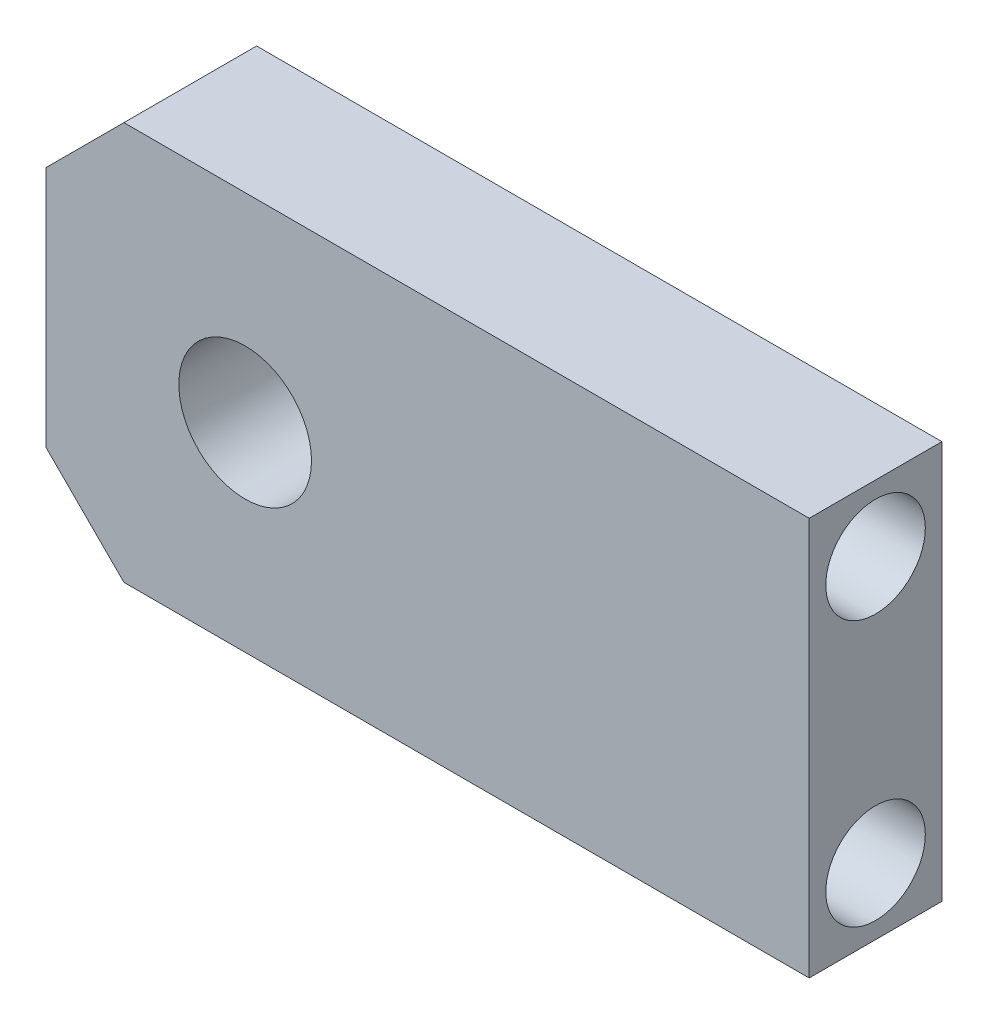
ISO-10303-21;
HEADER;
FILE_DESCRIPTION(('STEP AP214'),'2;1');
FILE_NAME('part.step','',(''),(''),'','','');
FILE_SCHEMA(('AUTOMOTIVE_DESIGN { 1 0 10303 214 1 1 1 1 }'));
ENDSEC;
DATA;
#1=APPLICATION_CONTEXT('core data for automotive mechanical design processes');
#2=APPLICATION_PROTOCOL_DEFINITION('international standard','automotive_design',2000,#1);
#3=PRODUCT_CONTEXT('',#1,'mechanical');
#4=PRODUCT('Part','Part','',(#3));
#5=PRODUCT_RELATED_PRODUCT_CATEGORY('part','',(#4));
#6=PRODUCT_DEFINITION_FORMATION('','',#4);
#7=PRODUCT_DEFINITION_CONTEXT('part definition',#1,'design');
#8=PRODUCT_DEFINITION('design','',#6,#7);
#9=PRODUCT_DEFINITION_SHAPE('','',#8);
#10=(LENGTH_UNIT() NAMED_UNIT(*) SI_UNIT(.MILLI.,.METRE.));
#11=(NAMED_UNIT(*) PLANE_ANGLE_UNIT() SI_UNIT($,.RADIAN.));
#12=(NAMED_UNIT(*) SI_UNIT($,.STERADIAN.) SOLID_ANGLE_UNIT());
#13=UNCERTAINTY_MEASURE_WITH_UNIT(LENGTH_MEASURE(1.E-05),#10,'distance_accuracy_value','');
#14=(GEOMETRIC_REPRESENTATION_CONTEXT(3) GLOBAL_UNCERTAINTY_ASSIGNED_CONTEXT((#13)) GLOBAL_UNIT_ASSIGNED_CONTEXT((#10,
#11,#12)) REPRESENTATION_CONTEXT('',''));
#15=CARTESIAN_POINT('',(0.,0.,0.));
#16=DIRECTION('',(0.,0.,1.));
#17=DIRECTION('',(1.,0.,0.));
#18=AXIS2_PLACEMENT_3D('',#15,#16,#17);
#19=CARTESIAN_POINT('',(-13.943342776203,3.65439093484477,4.));
#20=DIRECTION('',(0.707106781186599,-0.707106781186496,0.));
#21=DIRECTION('',(0.707106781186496,0.707106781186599,0.));
#22=AXIS2_PLACEMENT_3D('',#19,#20,#21);
#23=PLANE('',#22);
#24=DIRECTION('',(-0.707106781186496,-0.707106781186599,0.));
#25=VECTOR('',#24,1.);
#26=CARTESIAN_POINT('',(-13.943342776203,3.65439093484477,0.));
#27=LINE('',#26,#25);
#28=CARTESIAN_POINT('',(-11.5977337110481,6.,0.));
#29=VERTEX_POINT('',#28);
#30=CARTESIAN_POINT('',(-13.943342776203,3.65439093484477,0.));
#31=VERTEX_POINT('',#30);
#32=EDGE_CURVE('E118',#29,#31,#27,.T.);
#33=ORIENTED_EDGE('',*,*,#32,.T.);
#34=DIRECTION('',(0.,0.,-1.));
#35=VECTOR('',#34,1.);
#36=CARTESIAN_POINT('',(-13.943342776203,3.65439093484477,4.));
#37=LINE('',#36,#35);
#38=CARTESIAN_POINT('',(-13.943342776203,3.65439093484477,4.));
#39=VERTEX_POINT('',#38);
#40=EDGE_CURVE('E11',#39,#31,#37,.T.);
#41=ORIENTED_EDGE('',*,*,#40,.F.);
#42=DIRECTION('',(-0.707106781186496,-0.707106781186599,0.));
#43=VECTOR('',#42,1.);
#44=CARTESIAN_POINT('',(-13.943342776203,3.65439093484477,4.));
#45=LINE('',#44,#43);
#46=CARTESIAN_POINT('',(-11.5977337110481,6.,4.));
#47=VERTEX_POINT('',#46);
#48=EDGE_CURVE('E129',#47,#39,#45,.T.);
#49=ORIENTED_EDGE('',*,*,#48,.F.);
#50=DIRECTION('',(0.,0.,-1.));
#51=VECTOR('',#50,1.);
#52=CARTESIAN_POINT('',(-11.5977337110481,6.,4.));
#53=LINE('',#52,#51);
#54=EDGE_CURVE('E114',#47,#29,#53,.T.);
#55=ORIENTED_EDGE('',*,*,#54,.T.);
#56=EDGE_LOOP('',(#33,#41,#49,#55));
#57=FACE_BOUND('',#56,.T.);
#58=ADVANCED_FACE('F33',(#57),#23,.F.);
#59=CARTESIAN_POINT('',(-13.9433427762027,-3.65439093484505,4.));
#60=DIRECTION('',(1.,0.,0.));
#61=DIRECTION('',(0.,1.,0.));
#62=AXIS2_PLACEMENT_3D('',#59,#60,#61);
#63=PLANE('',#62);
#64=DIRECTION('',(0.,-1.,0.));
#65=VECTOR('',#64,1.);
#66=CARTESIAN_POINT('',(-13.9433427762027,-3.65439093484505,0.));
#67=LINE('',#66,#65);
#68=CARTESIAN_POINT('',(-13.9433427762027,-3.65439093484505,0.));
#69=VERTEX_POINT('',#68);
#70=EDGE_CURVE('E121',#31,#69,#67,.T.);
#71=ORIENTED_EDGE('',*,*,#70,.T.);
#72=DIRECTION('',(0.,0.,-1.));
#73=VECTOR('',#72,1.);
#74=CARTESIAN_POINT('',(-13.9433427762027,-3.65439093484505,4.));
#75=LINE('',#74,#73);
#76=CARTESIAN_POINT('',(-13.9433427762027,-3.65439093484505,4.));
#77=VERTEX_POINT('',#76);
#78=EDGE_CURVE('E42',#77,#69,#75,.T.);
#79=ORIENTED_EDGE('',*,*,#78,.F.);
#80=DIRECTION('',(0.,-1.,0.));
#81=VECTOR('',#80,1.);
#82=CARTESIAN_POINT('',(-13.9433427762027,-3.65439093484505,4.));
#83=LINE('',#82,#81);
#84=EDGE_CURVE('E87',#39,#77,#83,.T.);
#85=ORIENTED_EDGE('',*,*,#84,.F.);
#86=ORIENTED_EDGE('',*,*,#40,.T.);
#87=EDGE_LOOP('',(#71,#79,#85,#86));
#88=FACE_BOUND('',#87,.T.);
#89=ADVANCED_FACE('F156',(#88),#63,.F.);
#90=CARTESIAN_POINT('',(-13.9433427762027,-3.65439093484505,4.));
#91=DIRECTION('',(0.707106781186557,0.707106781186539,0.));
#92=DIRECTION('',(-0.707106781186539,0.707106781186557,0.));
#93=AXIS2_PLACEMENT_3D('',#90,#91,#92);
#94=PLANE('',#93);
#95=DIRECTION('',(0.707106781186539,-0.707106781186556,0.));
#96=VECTOR('',#95,1.);
#97=CARTESIAN_POINT('',(-13.9433427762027,-3.65439093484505,0.));
#98=LINE('',#97,#96);
#99=CARTESIAN_POINT('',(-11.5977337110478,-6.,0.));
#100=VERTEX_POINT('',#99);
#101=EDGE_CURVE('E124',#69,#100,#98,.T.);
#102=ORIENTED_EDGE('',*,*,#101,.T.);
#103=DIRECTION('',(0.,0.,-1.));
#104=VECTOR('',#103,1.);
#105=CARTESIAN_POINT('',(-11.5977337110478,-6.,4.));
#106=LINE('',#105,#104);
#107=CARTESIAN_POINT('',(-11.5977337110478,-6.,4.));
#108=VERTEX_POINT('',#107);
#109=EDGE_CURVE('E109',#108,#100,#106,.T.);
#110=ORIENTED_EDGE('',*,*,#109,.F.);
#111=DIRECTION('',(0.707106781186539,-0.707106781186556,0.));
#112=VECTOR('',#111,1.);
#113=CARTESIAN_POINT('',(-13.9433427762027,-3.65439093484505,4.));
#114=LINE('',#113,#112);
#115=EDGE_CURVE('E100',#77,#108,#114,.T.);
#116=ORIENTED_EDGE('',*,*,#115,.F.);
#117=ORIENTED_EDGE('',*,*,#78,.T.);
#118=EDGE_LOOP('',(#102,#110,#116,#117));
#119=FACE_BOUND('',#118,.T.);
#120=ADVANCED_FACE('F136',(#119),#94,.F.);
#121=CARTESIAN_POINT('',(-11.5977337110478,-6.,4.));
#122=DIRECTION('',(0.,1.,0.));
#123=DIRECTION('',(0.,0.,1.));
#124=AXIS2_PLACEMENT_3D('',#121,#122,#123);
#125=PLANE('',#124);
#126=DIRECTION('',(1.,0.,0.));
#127=VECTOR('',#126,1.);
#128=CARTESIAN_POINT('',(-11.5977337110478,-6.,0.));
#129=LINE('',#128,#127);
#130=CARTESIAN_POINT('',(9.05665722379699,-6.,0.));
#131=VERTEX_POINT('',#130);
#132=EDGE_CURVE('E108',#100,#131,#129,.T.);
#133=ORIENTED_EDGE('',*,*,#132,.T.);
#134=DIRECTION('',(0.,0.,-1.));
#135=VECTOR('',#134,1.);
#136=CARTESIAN_POINT('',(9.05665722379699,-6.,4.));
#137=LINE('',#136,#135);
#138=CARTESIAN_POINT('',(9.05665722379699,-6.,4.));
#139=VERTEX_POINT('',#138);
#140=EDGE_CURVE('E105',#139,#131,#137,.T.);
#141=ORIENTED_EDGE('',*,*,#140,.F.);
#142=DIRECTION('',(1.,0.,0.));
#143=VECTOR('',#142,1.);
#144=CARTESIAN_POINT('',(-11.5977337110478,-6.,4.));
#145=LINE('',#144,#143);
#146=EDGE_CURVE('E94',#108,#139,#145,.T.);
#147=ORIENTED_EDGE('',*,*,#146,.F.);
#148=ORIENTED_EDGE('',*,*,#109,.T.);
#149=EDGE_LOOP('',(#133,#141,#147,#148));
#150=FACE_BOUND('',#149,.T.);
#151=ADVANCED_FACE('F106',(#150),#125,.F.);
#152=CARTESIAN_POINT('',(9.05665722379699,6.,4.));
#153=DIRECTION('',(-1.,0.,0.));
#154=DIRECTION('',(0.,0.,1.));
#155=AXIS2_PLACEMENT_3D('',#152,#153,#154);
#156=PLANE('',#155);
#157=CARTESIAN_POINT('',(9.05665722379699,4.,2.));
#158=DIRECTION('',(1.,0.,0.));
#159=DIRECTION('',(0.,0.,-1.));
#160=AXIS2_PLACEMENT_3D('',#157,#158,#159);
#161=CIRCLE('',#160,1.5);
#162=CARTESIAN_POINT('',(9.05665722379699,4.,0.5));
#163=VERTEX_POINT('',#162);
#164=EDGE_CURVE('E255',#163,#163,#161,.T.);
#165=ORIENTED_EDGE('',*,*,#164,.F.);
#166=EDGE_LOOP('',(#165));
#167=FACE_BOUND('',#166,.T.);
#168=CARTESIAN_POINT('',(9.05665722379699,-4.,2.));
#169=DIRECTION('',(1.,0.,0.));
#170=DIRECTION('',(0.,0.,-1.));
#171=AXIS2_PLACEMENT_3D('',#168,#169,#170);
#172=CIRCLE('',#171,1.5);
#173=CARTESIAN_POINT('',(9.05665722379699,-4.,0.5));
#174=VERTEX_POINT('',#173);
#175=EDGE_CURVE('E251',#174,#174,#172,.T.);
#176=ORIENTED_EDGE('',*,*,#175,.F.);
#177=EDGE_LOOP('',(#176));
#178=FACE_BOUND('',#177,.T.);
#179=DIRECTION('',(0.,1.,0.));
#180=VECTOR('',#179,1.);
#181=CARTESIAN_POINT('',(9.05665722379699,6.,0.));
#182=LINE('',#181,#180);
#183=CARTESIAN_POINT('',(9.05665722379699,6.,0.));
#184=VERTEX_POINT('',#183);
#185=EDGE_CURVE('E73',#131,#184,#182,.T.);
#186=ORIENTED_EDGE('',*,*,#185,.T.);
#187=DIRECTION('',(0.,0.,-1.));
#188=VECTOR('',#187,1.);
#189=CARTESIAN_POINT('',(9.05665722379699,6.,4.));
#190=LINE('',#189,#188);
#191=CARTESIAN_POINT('',(9.05665722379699,6.,4.));
#192=VERTEX_POINT('',#191);
#193=EDGE_CURVE('E110',#192,#184,#190,.T.);
#194=ORIENTED_EDGE('',*,*,#193,.F.);
#195=DIRECTION('',(0.,1.,0.));
#196=VECTOR('',#195,1.);
#197=CARTESIAN_POINT('',(9.05665722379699,6.,4.));
#198=LINE('',#197,#196);
#199=EDGE_CURVE('E98',#139,#192,#198,.T.);
#200=ORIENTED_EDGE('',*,*,#199,.F.);
#201=ORIENTED_EDGE('',*,*,#140,.T.);
#202=EDGE_LOOP('',(#186,#194,#200,#201));
#203=FACE_BOUND('',#202,.T.);
#204=ADVANCED_FACE('F112',(#167,#178,#203),#156,.F.);
#205=CARTESIAN_POINT('',(-11.5977337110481,6.,4.));
#206=DIRECTION('',(0.,-1.,0.));
#207=DIRECTION('',(0.,0.,-1.));
#208=AXIS2_PLACEMENT_3D('',#205,#206,#207);
#209=PLANE('',#208);
#210=DIRECTION('',(-1.,0.,0.));
#211=VECTOR('',#210,1.);
#212=CARTESIAN_POINT('',(-11.5977337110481,6.,0.));
#213=LINE('',#212,#211);
#214=EDGE_CURVE('E79',#184,#29,#213,.T.);
#215=ORIENTED_EDGE('',*,*,#214,.T.);
#216=ORIENTED_EDGE('',*,*,#54,.F.);
#217=DIRECTION('',(-1.,0.,0.));
#218=VECTOR('',#217,1.);
#219=CARTESIAN_POINT('',(-11.5977337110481,6.,4.));
#220=LINE('',#219,#218);
#221=EDGE_CURVE('E50',#192,#47,#220,.T.);
#222=ORIENTED_EDGE('',*,*,#221,.F.);
#223=ORIENTED_EDGE('',*,*,#193,.T.);
#224=EDGE_LOOP('',(#215,#216,#222,#223));
#225=FACE_BOUND('',#224,.T.);
#226=ADVANCED_FACE('F143',(#225),#209,.F.);
#227=CARTESIAN_POINT('',(0.,0.,4.));
#228=DIRECTION('',(0.,0.,-1.));
#229=DIRECTION('',(-1.,0.,0.));
#230=AXIS2_PLACEMENT_3D('',#227,#228,#229);
#231=PLANE('',#230);
#232=CARTESIAN_POINT('',(-7.94334277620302,0.,4.));
#233=DIRECTION('',(0.,0.,1.));
#234=DIRECTION('',(1.,0.,0.));
#235=AXIS2_PLACEMENT_3D('',#232,#233,#234);
#236=CIRCLE('',#235,2.);
#237=CARTESIAN_POINT('',(-5.94334277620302,0.,4.));
#238=VERTEX_POINT('',#237);
#239=EDGE_CURVE('E249',#238,#238,#236,.T.);
#240=ORIENTED_EDGE('',*,*,#239,.F.);
#241=EDGE_LOOP('',(#240));
#242=FACE_BOUND('',#241,.T.);
#243=ORIENTED_EDGE('',*,*,#48,.T.);
#244=ORIENTED_EDGE('',*,*,#84,.T.);
#245=ORIENTED_EDGE('',*,*,#115,.T.);
#246=ORIENTED_EDGE('',*,*,#146,.T.);
#247=ORIENTED_EDGE('',*,*,#199,.T.);
#248=ORIENTED_EDGE('',*,*,#221,.T.);
#249=EDGE_LOOP('',(#243,#244,#245,#246,#247,#248));
#250=FACE_BOUND('',#249,.T.);
#251=ADVANCED_FACE('F96',(#242,#250),#231,.F.);
#252=CARTESIAN_POINT('',(0.,0.,0.));
#253=DIRECTION('',(0.,0.,-1.));
#254=DIRECTION('',(-1.,0.,0.));
#255=AXIS2_PLACEMENT_3D('',#252,#253,#254);
#256=PLANE('',#255);
#257=CARTESIAN_POINT('',(-7.94334277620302,0.,0.));
#258=DIRECTION('',(0.,0.,-1.));
#259=DIRECTION('',(-1.,0.,0.));
#260=AXIS2_PLACEMENT_3D('',#257,#258,#259);
#261=CIRCLE('',#260,2.);
#262=CARTESIAN_POINT('',(-9.94334277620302,0.,0.));
#263=VERTEX_POINT('',#262);
#264=EDGE_CURVE('E36',#263,#263,#261,.T.);
#265=ORIENTED_EDGE('',*,*,#264,.F.);
#266=EDGE_LOOP('',(#265));
#267=FACE_BOUND('',#266,.T.);
#268=ORIENTED_EDGE('',*,*,#32,.F.);
#269=ORIENTED_EDGE('',*,*,#214,.F.);
#270=ORIENTED_EDGE('',*,*,#185,.F.);
#271=ORIENTED_EDGE('',*,*,#132,.F.);
#272=ORIENTED_EDGE('',*,*,#101,.F.);
#273=ORIENTED_EDGE('',*,*,#70,.F.);
#274=EDGE_LOOP('',(#268,#269,#270,#271,#272,#273));
#275=FACE_BOUND('',#274,.T.);
#276=ADVANCED_FACE('F139',(#267,#275),#256,.T.);
#277=CARTESIAN_POINT('',(-0.943342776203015,-4.,2.));
#278=DIRECTION('',(1.,0.,0.));
#279=DIRECTION('',(0.,0.,-1.));
#280=AXIS2_PLACEMENT_3D('',#277,#278,#279);
#281=CYLINDRICAL_SURFACE('',#280,1.5);
#282=CARTESIAN_POINT('',(-0.943342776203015,-4.,2.));
#283=DIRECTION('',(1.,0.,0.));
#284=DIRECTION('',(0.,0.,-1.));
#285=AXIS2_PLACEMENT_3D('',#282,#283,#284);
#286=CIRCLE('',#285,1.5);
#287=CARTESIAN_POINT('',(-0.943342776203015,-4.,0.5));
#288=VERTEX_POINT('',#287);
#289=EDGE_CURVE('E258',#288,#288,#286,.T.);
#290=ORIENTED_EDGE('',*,*,#289,.F.);
#291=EDGE_LOOP('',(#290));
#292=FACE_BOUND('',#291,.T.);
#293=ORIENTED_EDGE('',*,*,#175,.T.);
#294=EDGE_LOOP('',(#293));
#295=FACE_BOUND('',#294,.T.);
#296=ADVANCED_FACE('F181',(#292,#295),#281,.F.);
#297=CARTESIAN_POINT('',(-0.943342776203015,-4.,2.));
#298=DIRECTION('',(1.,0.,0.));
#299=DIRECTION('',(0.,0.,-1.));
#300=AXIS2_PLACEMENT_3D('',#297,#298,#299);
#301=PLANE('',#300);
#302=ORIENTED_EDGE('',*,*,#289,.T.);
#303=EDGE_LOOP('',(#302));
#304=FACE_BOUND('',#303,.T.);
#305=ADVANCED_FACE('F186',(#304),#301,.T.);
#306=CARTESIAN_POINT('',(-0.943342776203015,4.,2.));
#307=DIRECTION('',(1.,0.,0.));
#308=DIRECTION('',(0.,0.,-1.));
#309=AXIS2_PLACEMENT_3D('',#306,#307,#308);
#310=CYLINDRICAL_SURFACE('',#309,1.5);
#311=CARTESIAN_POINT('',(-0.943342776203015,4.,2.));
#312=DIRECTION('',(1.,0.,0.));
#313=DIRECTION('',(0.,0.,-1.));
#314=AXIS2_PLACEMENT_3D('',#311,#312,#313);
#315=CIRCLE('',#314,1.5);
#316=CARTESIAN_POINT('',(-0.943342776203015,4.,0.5));
#317=VERTEX_POINT('',#316);
#318=EDGE_CURVE('E122',#317,#317,#315,.T.);
#319=ORIENTED_EDGE('',*,*,#318,.F.);
#320=EDGE_LOOP('',(#319));
#321=FACE_BOUND('',#320,.T.);
#322=ORIENTED_EDGE('',*,*,#164,.T.);
#323=EDGE_LOOP('',(#322));
#324=FACE_BOUND('',#323,.T.);
#325=ADVANCED_FACE('F198',(#321,#324),#310,.F.);
#326=CARTESIAN_POINT('',(-0.943342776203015,4.,2.));
#327=DIRECTION('',(1.,0.,0.));
#328=DIRECTION('',(0.,0.,-1.));
#329=AXIS2_PLACEMENT_3D('',#326,#327,#328);
#330=PLANE('',#329);
#331=ORIENTED_EDGE('',*,*,#318,.T.);
#332=EDGE_LOOP('',(#331));
#333=FACE_BOUND('',#332,.T.);
#334=ADVANCED_FACE('F208',(#333),#330,.T.);
#335=CARTESIAN_POINT('',(-7.94334277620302,0.,-6.));
#336=DIRECTION('',(0.,0.,1.));
#337=DIRECTION('',(1.,0.,0.));
#338=AXIS2_PLACEMENT_3D('',#335,#336,#337);
#339=CYLINDRICAL_SURFACE('',#338,2.);
#340=ORIENTED_EDGE('',*,*,#264,.T.);
#341=EDGE_LOOP('',(#340));
#342=FACE_BOUND('',#341,.T.);
#343=ORIENTED_EDGE('',*,*,#239,.T.);
#344=EDGE_LOOP('',(#343));
#345=FACE_BOUND('',#344,.T.);
#346=ADVANCED_FACE('F218',(#342,#345),#339,.F.);
#347=CLOSED_SHELL('',(#58,#89,#120,#151,#204,#226,#251,#276,#296,#305,#325,#334,#346));
#348=MANIFOLD_SOLID_BREP('B2',#347);
#349=ADVANCED_BREP_SHAPE_REPRESENTATION('',(#18,#348),#14);
#350=SHAPE_DEFINITION_REPRESENTATION(#9,#349);
ENDSEC;
END-ISO-10303-21;
